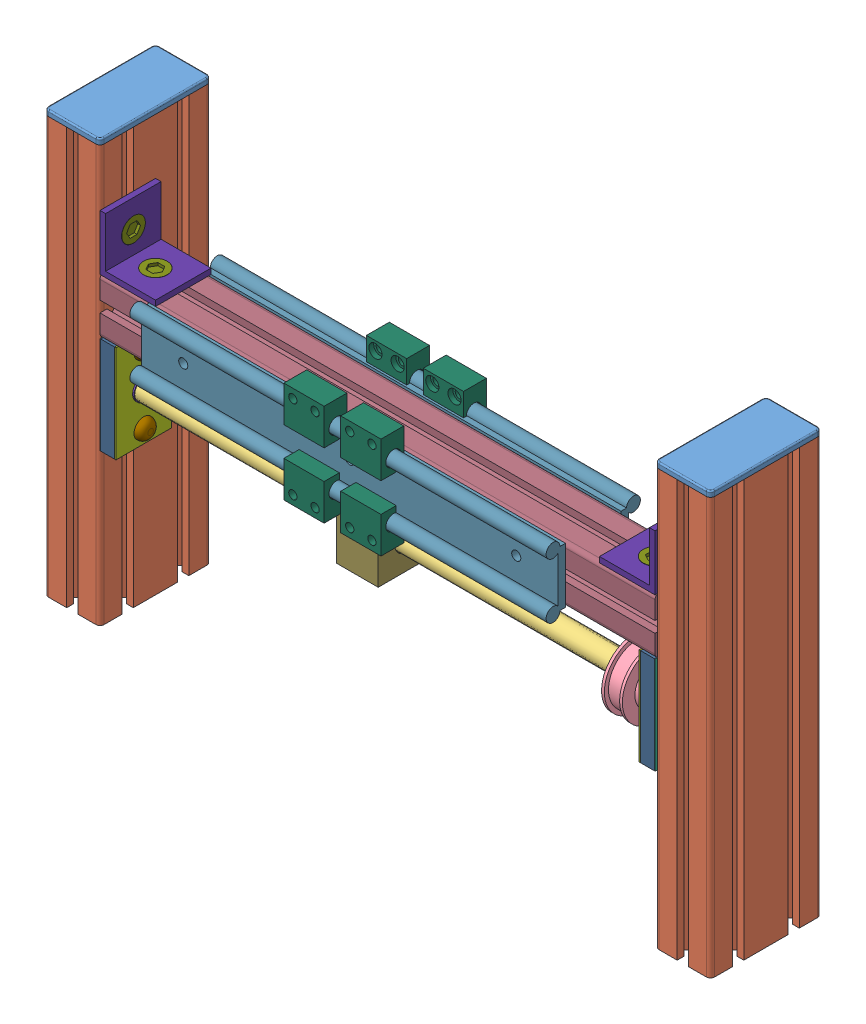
SolidWorks assembly Y-1-Base + Eje (sin soporte Z) .SLDASM, configuration Predeterminado (file format 3800). Lengths in mm.
Overall size (480 304 98).
54 component instances, 17 part files, 0 mates.
Components (placement in the parent):
- Y-Tapa Perfil AL 40x80-1: Y-Tapa Perfil AL 40x80.SLDPRT [Predeterminado] at (260 100 0) x (0 0 -1) z (0 1 0) size (80 40 4)
- Y-Tapa Perfil AL 40x80-2: Y-Tapa Perfil AL 40x80.SLDPRT [Predeterminado] at (-180 100 0) x (0 0 -1) z (0 1 0) size (80 40 4)
- Y-1-Base + Eje (sin tapas ni soporte Z) -2: Y-1-Base + Eje (sin tapas ni soporte Z) .SLDASM [Predeterminado] at origin size (480 300 98)
  - Y-Pervil AL estructura 4x8x300-1: Y-Pervil AL estructura 4x8x300.SLDPRT [Predeterminado] at (260 100 -40) x (0 0 1) z (0 -1 0) size (80 40 300)
  - Y-Pervil AL estructura 4x8x300-2: Y-Pervil AL estructura 4x8x300.SLDPRT [Predeterminado] at (-180 100 -40) x (0 0 1) z (0 -1 0) size (80 40 300)
  - Y-Husillo con apollos y tureca-1: Y-Husillo con apollos y tureca.SLDASM [Predeterminado] at (-147.5 -55 0) x (0 1 0) z (1 0 0) size (70 62 417)
    - Y-Husillo con apollos-1: Y-Husillo con apollos.SLDASM [Predeterminado] at origin size (70 48 417)
      - Y-Husillo-1: Y-Husillo.SLDPRT [Predeterminado] at origin size (15 15 397)
      - Y-Polea (26 XL 037)-1: Y-Polea (26 XL 037).SLDPRT [Predeterminado] at (0 0 353) x (1 0 0) z (0 -1 0) size (48 22 48)
      - Y-Rodamiento completo-1: Y-Rodamiento completo.SLDASM [Predeterminado] at (0 0 -2) size (70 40 25)
        - Y-Apollo Soporte-1: Y-Apollo Soporte.SLDPRT [Predeterminado] at (0 0 -10) x (-1 0 0) z (0 0 -1) size (70 40 0.5)
        - Y-Protector completo fino-1: Y-Protector completo fino.SLDPRT [Predeterminado] at (0 0 -10.5) x (-1 0 0) z (0 0 -1) size (70 40 0.1)
        - Y-Protector con agujero-1: Y-Protector con agujero.SLDPRT [Predeterminado] at (0 0 1) x (-1 0 0) z (0 0 -1) size (70 40 1)
        - Y-Funda ()-1: Y-Funda ().SLDPRT [Predeterminado] at (0 0 2) x (-1 0 0) z (0 0 -1) size (16 16 10)
        - Y-Rodamiento con soporte y tornillo-1: Y-Rodamiento con soporte y tornillo.SLDASM [Predeterminado] at (0 0 0.5) size (70 40 25)
          - Y-Tornillo M8 x20-2: Y-Tornillo M8 x20.SLDPRT [Predeterminado] at (-25 0 5.5) x (-1 0 0) z (0 0 -1) size (14 14 25)
          - Y-Tornillo M8 x20-1: Y-Tornillo M8 x20.SLDPRT [Predeterminado] at (25 0 5.5) x (-1 0 0) z (0 0 -1) size (14 14 25)
          - Y-Rodamiento con soporte-1: Y-Rodamiento con soporte.SLDASM [Predeterminado] at (0 0 -10.5) size (70 40 10)
            - Y-Soporte rodamiento-1: Y-Soporte rodamiento.SLDPRT [Predeterminado] at origin size (70 40 10)
            - Y-Rodamiento (7201.2RS.TVP)-1: Y-Rodamiento (7201.2RS.TVP).SLDPRT [Predeterminado] at origin size (32 32 10)
      - Y-Rodamiento completo-2: Y-Rodamiento completo.SLDASM [Predeterminado] at (0 0 377) x (-1 0 0) z (0 0 -1) size (70 40 25)
        - Y-Apollo Soporte-1: Y-Apollo Soporte.SLDPRT [Predeterminado] at (0 0 -10) x (-1 0 0) z (0 0 -1) size (70 40 0.5)
        - Y-Protector completo fino-1: Y-Protector completo fino.SLDPRT [Predeterminado] at (0 0 -10.5) x (-1 0 0) z (0 0 -1) size (70 40 0.1)
        - Y-Protector con agujero-1: Y-Protector con agujero.SLDPRT [Predeterminado] at (0 0 1) x (-1 0 0) z (0 0 -1) size (70 40 1)
        - Y-Funda ()-1: Y-Funda ().SLDPRT [Predeterminado] at (0 0 2) x (-1 0 0) z (0 0 -1) size (16 16 10)
        - Y-Rodamiento con soporte y tornillo-1: Y-Rodamiento con soporte y tornillo.SLDASM [Predeterminado] at (0 0 0.5) size (70 40 25)
          - Y-Tornillo M8 x20-2: Y-Tornillo M8 x20.SLDPRT [Predeterminado] at (-25 0 5.5) x (-1 0 0) z (0 0 -1) size (14 14 25)
          - Y-Tornillo M8 x20-1: Y-Tornillo M8 x20.SLDPRT [Predeterminado] at (25 0 5.5) x (-1 0 0) z (0 0 -1) size (14 14 25)
          - Y-Rodamiento con soporte-1: Y-Rodamiento con soporte.SLDASM [Predeterminado] at (0 0 -10.5) size (70 40 10)
            - Y-Soporte rodamiento-1: Y-Soporte rodamiento.SLDPRT [Predeterminado] at origin size (70 40 10)
            - Y-Rodamiento (7201.2RS.TVP)-1: Y-Rodamiento (7201.2RS.TVP).SLDPRT [Predeterminado] at origin size (32 32 10)
    - Y-Turerca nylon-1: Y-Turerca nylon.SLDPRT [Predeterminado] at (0 20 173) x (1 0 0) z (0 -1 0) size (40 30 58)
  - Y-Soprte deslizaderas-1: Y-Soprte deslizaderas.SLDASM [Predeterminado] at (175 0 0) x (0 0 -1) z (1 0 0) size (76 73 400)
    - Y-Pervil AL estructura 4x4x400-1: Y-Pervil AL estructura 4x4x400.SLDPRT [Predeterminado] at (0 0 65) x (0 1 0) z (0 0 -1) size (40 40 400)
    - Y-Deslizaderas con patines-1: Y-Deslizaderas con patines.SLDASM [Predeterminado] at (0 0 -299.5) x (1 0 0) z (0 0 -1) size (18 73 300)
      - Y-Deslizadera doble-1: Y-Deslizadera doble.SLDPRT [Predeterminado] at (-22.75 0 0) x (0 -1 0) z (0 0 -1) size (50 14 300)
      - Y-Patin-1: Y-Patin.SLDPRT [Predeterminado] at (-29.75 -23.5 -185) x (0 1 0) z (0 0 1) size (26 16.5 29)
      - Y-Patin-3: Y-Patin.SLDPRT [Predeterminado] at (-29.75 23.5 -156) x (0 -1 0) z (0 0 -1) size (26 16.5 29)
      - Y-Patin-4: Y-Patin.SLDPRT [Predeterminado] at (-29.75 23.5 -115) x (0 -1 0) z (0 0 -1) size (26 16.5 29)
      - Y-Patin-6: Y-Patin.SLDPRT [Predeterminado] at (-29.75 -23.5 -144) x (0 1 0) z (0 0 1) size (26 16.5 29)
    - Y-Deslizaderas con patines-2: Y-Deslizaderas con patines.SLDASM [Predeterminado] at (0 0 0.5) x (-1 0 0) z (0 0 1) size (18 73 300)
      - Y-Deslizadera doble-1: Y-Deslizadera doble.SLDPRT [Predeterminado] at (-22.75 0 0) x (0 -1 0) z (0 0 -1) size (50 14 300)
      - Y-Patin-1: Y-Patin.SLDPRT [Predeterminado] at (-29.75 -23.5 -185) x (0 1 0) z (0 0 1) size (26 16.5 29)
      - Y-Patin-3: Y-Patin.SLDPRT [Predeterminado] at (-29.75 23.5 -156) x (0 -1 0) z (0 0 -1) size (26 16.5 29)
      - Y-Patin-4: Y-Patin.SLDPRT [Predeterminado] at (-29.75 23.5 -115) x (0 -1 0) z (0 0 -1) size (26 16.5 29)
      - Y-Patin-6: Y-Patin.SLDPRT [Predeterminado] at (-29.75 -23.5 -144) x (0 1 0) z (0 0 1) size (26 16.5 29)
  - Y-Angulo con tornillos-2: Y-Angulo con tornillos.SLDASM [Predeterminado] at (-160 20 -20) size (55.92 55.89 40)
    - Y-Tornillo M8 x16-1: Y-Tornillo M8 x16.SLDPRT [Predeterminado] at (19.9756 -15.8873 20.1118) size (17 20 17)
    - Y-Angulo 40x40 L (0.0.196.87)-1: Y-Angulo 40x40 L (0.0.196.87).SLDPRT [Predeterminado] at origin size (40 40 40)
    - Y-Tornillo M8 x16-2: Y-Tornillo M8 x16.SLDPRT [Predeterminado] at (-15.9177 20.1326 19.8969) x (0 0 1) z (0 1 0) size (17 20 17)
  - Y-Angulo con tornillos-1: Y-Angulo con tornillos.SLDASM [Predeterminado] at (240 20 -20) x (0 1 0) z (0 0 1) size (55.92 55.89 40)
    - Y-Tornillo M8 x16-1: Y-Tornillo M8 x16.SLDPRT [Predeterminado] at (19.9756 -15.8873 20.1118) size (17 20 17)
    - Y-Angulo 40x40 L (0.0.196.87)-1: Y-Angulo 40x40 L (0.0.196.87).SLDPRT [Predeterminado] at origin size (40 40 40)
    - Y-Tornillo M8 x16-2: Y-Tornillo M8 x16.SLDPRT [Predeterminado] at (-15.9177 20.1326 19.8969) x (0 0 1) z (0 1 0) size (17 20 17)
